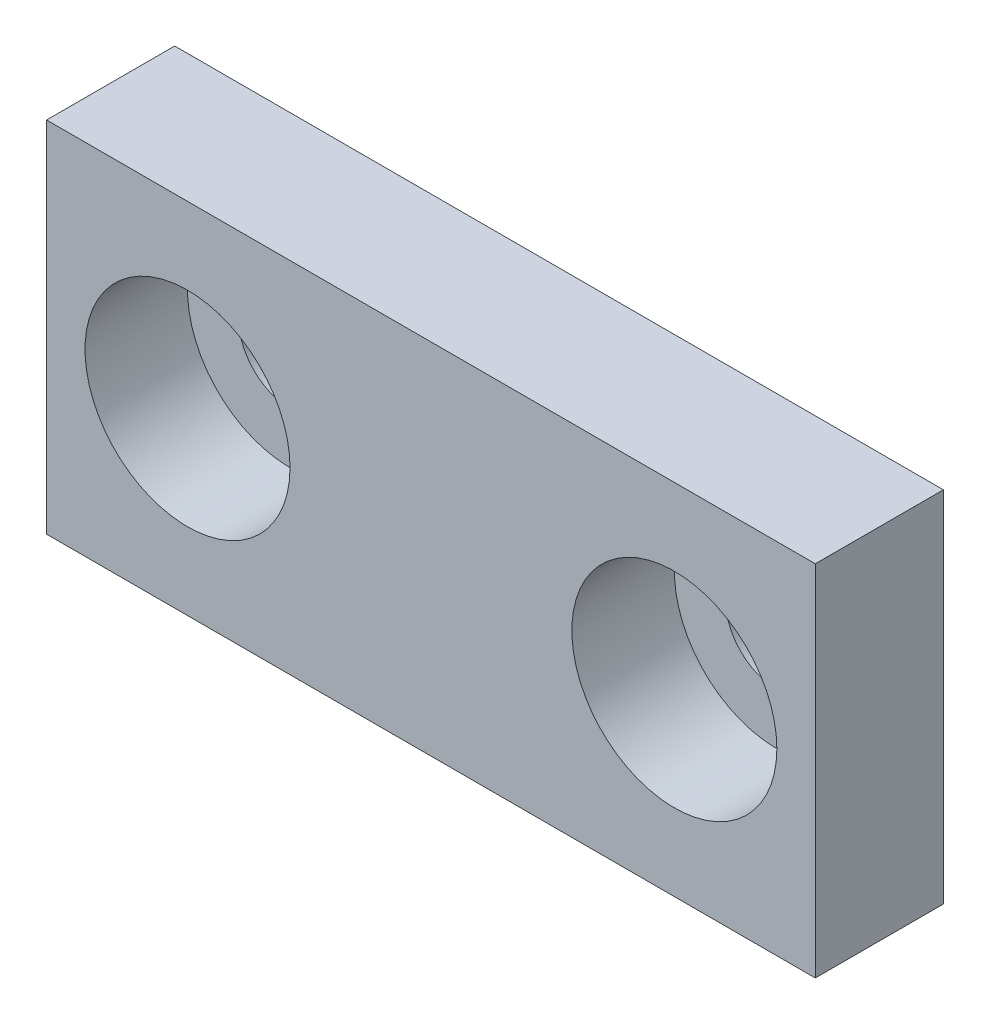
from build123d import *

# Parameters (mm, degrees)
SKETCH1_W           = 30
SKETCH1_H           = 14
BOSS_EXTRUDE1_DEPTH = 5
SKETCH2_R           = 4
CUT_EXTRUDE1_DEPTH  = 4
SKETCH3_R           = 2
CUT_EXTRUDE2_DEPTH  = 18.029386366


with BuildPart() as part:
    # Sketch1 → Boss-Extrude1 (new body)
    with BuildSketch(Plane.XY):
        Rectangle(SKETCH1_W, SKETCH1_H)
    extrude(amount=BOSS_EXTRUDE1_DEPTH)

    # Sketch2 → Cut-Extrude1 (cut)
    with BuildSketch(Plane.XY.offset(5)):
        with Locations((9.5, 0)):
            Circle(SKETCH2_R)
        with Locations((-9.5, 0)):
            Circle(SKETCH2_R)
    extrude(amount=-CUT_EXTRUDE1_DEPTH, mode=Mode.SUBTRACT)

    # Sketch3 → Cut-Extrude2 (cut, through all)
    with BuildSketch(Plane.XY.offset(1)):
        with Locations((-9.5, 0)):
            Circle(SKETCH3_R)
        with Locations((9.5, 0)):
            Circle(SKETCH3_R)
    extrude(amount=-CUT_EXTRUDE2_DEPTH, mode=Mode.SUBTRACT)


solid = part.part
